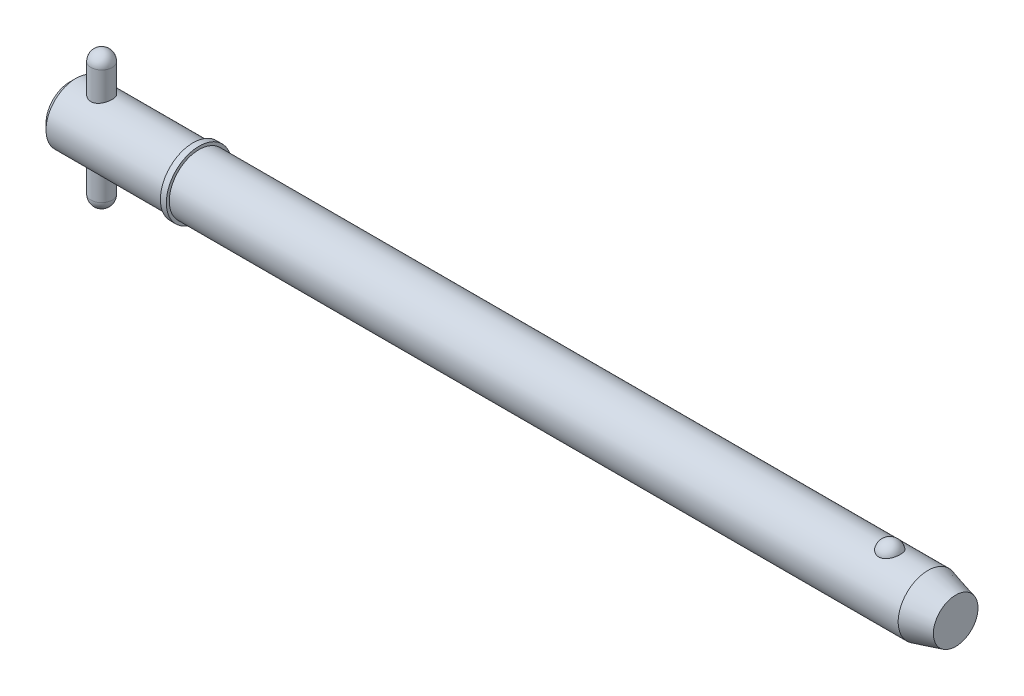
ISO-10303-21;
HEADER;
FILE_DESCRIPTION(('STEP AP214'),'2;1');
FILE_NAME('part.step','',(''),(''),'','','');
FILE_SCHEMA(('AUTOMOTIVE_DESIGN { 1 0 10303 214 1 1 1 1 }'));
ENDSEC;
DATA;
#1=APPLICATION_CONTEXT('core data for automotive mechanical design processes');
#2=APPLICATION_PROTOCOL_DEFINITION('international standard','automotive_design',2000,#1);
#3=PRODUCT_CONTEXT('',#1,'mechanical');
#4=PRODUCT('Part','Part','',(#3));
#5=PRODUCT_RELATED_PRODUCT_CATEGORY('part','',(#4));
#6=PRODUCT_DEFINITION_FORMATION('','',#4);
#7=PRODUCT_DEFINITION_CONTEXT('part definition',#1,'design');
#8=PRODUCT_DEFINITION('design','',#6,#7);
#9=PRODUCT_DEFINITION_SHAPE('','',#8);
#10=(LENGTH_UNIT() NAMED_UNIT(*) SI_UNIT(.MILLI.,.METRE.));
#11=(NAMED_UNIT(*) PLANE_ANGLE_UNIT() SI_UNIT($,.RADIAN.));
#12=(NAMED_UNIT(*) SI_UNIT($,.STERADIAN.) SOLID_ANGLE_UNIT());
#13=UNCERTAINTY_MEASURE_WITH_UNIT(LENGTH_MEASURE(1.E-05),#10,'distance_accuracy_value','');
#14=(GEOMETRIC_REPRESENTATION_CONTEXT(3) GLOBAL_UNCERTAINTY_ASSIGNED_CONTEXT((#13)) GLOBAL_UNIT_ASSIGNED_CONTEXT((#10,
#11,#12)) REPRESENTATION_CONTEXT('',''));
#15=CARTESIAN_POINT('',(0.,0.,0.));
#16=DIRECTION('',(0.,0.,1.));
#17=DIRECTION('',(1.,0.,0.));
#18=AXIS2_PLACEMENT_3D('',#15,#16,#17);
#19=CARTESIAN_POINT('',(5.94,12.7,0.));
#20=DIRECTION('',(0.,-1.,0.));
#21=DIRECTION('',(0.,0.,-1.));
#22=AXIS2_PLACEMENT_3D('',#19,#20,#21);
#23=CYLINDRICAL_SURFACE('',#22,1.98);
#24=CARTESIAN_POINT('',(5.94,-10.72,0.));
#25=DIRECTION('',(0.,-1.,0.));
#26=DIRECTION('',(0.,0.,-1.));
#27=AXIS2_PLACEMENT_3D('',#24,#25,#26);
#28=CIRCLE('',#27,1.98);
#29=CARTESIAN_POINT('',(5.94,-10.72,-1.98));
#30=VERTEX_POINT('',#29);
#31=EDGE_CURVE('P0_E10',#30,#30,#28,.F.);
#32=ORIENTED_EDGE('',*,*,#31,.T.);
#33=EDGE_LOOP('',(#32));
#34=FACE_BOUND('',#33,.T.);
#35=CARTESIAN_POINT('',(5.94,10.72,0.));
#36=DIRECTION('',(0.,-1.,0.));
#37=DIRECTION('',(0.,0.,-1.));
#38=AXIS2_PLACEMENT_3D('',#35,#36,#37);
#39=CIRCLE('',#38,1.98);
#40=CARTESIAN_POINT('',(5.94,10.72,-1.98));
#41=VERTEX_POINT('',#40);
#42=EDGE_CURVE('P0_E21',#41,#41,#39,.T.);
#43=ORIENTED_EDGE('',*,*,#42,.T.);
#44=EDGE_LOOP('',(#43));
#45=FACE_BOUND('',#44,.T.);
#46=ADVANCED_FACE('P0_F14',(#34,#45),#23,.T.);
#47=CARTESIAN_POINT('',(5.94,-10.72,0.));
#48=DIRECTION('',(0.,0.,1.));
#49=DIRECTION('',(1.,0.,0.));
#50=AXIS2_PLACEMENT_3D('',#47,#48,#49);
#51=SPHERICAL_SURFACE('',#50,1.98);
#52=CARTESIAN_POINT('',(5.94,-10.72,0.));
#53=DIRECTION('',(0.,-1.,0.));
#54=DIRECTION('',(0.,0.,-1.));
#55=AXIS2_PLACEMENT_3D('',#52,#53,#54);
#56=SPHERICAL_SURFACE('',#55,1.98);
#57=ORIENTED_EDGE('',*,*,#31,.F.);
#58=EDGE_LOOP('',(#57));
#59=FACE_BOUND('',#58,.T.);
#60=ADVANCED_FACE('P0_F29',(#59),#56,.T.);
#61=CARTESIAN_POINT('',(5.94,10.72,0.));
#62=DIRECTION('',(0.,0.,1.));
#63=DIRECTION('',(1.,0.,0.));
#64=AXIS2_PLACEMENT_3D('',#61,#62,#63);
#65=SPHERICAL_SURFACE('',#64,1.98);
#66=CARTESIAN_POINT('',(5.94,10.72,0.));
#67=DIRECTION('',(0.,-1.,0.));
#68=DIRECTION('',(0.,0.,-1.));
#69=AXIS2_PLACEMENT_3D('',#66,#67,#68);
#70=SPHERICAL_SURFACE('',#69,1.98);
#71=ORIENTED_EDGE('',*,*,#42,.F.);
#72=EDGE_LOOP('',(#71));
#73=FACE_BOUND('',#72,.T.);
#74=ADVANCED_FACE('P0_F16',(#73),#70,.T.);
#75=CLOSED_SHELL('',(#46,#60,#74));
#76=MANIFOLD_SOLID_BREP('P0_B1',#75);
#77=CARTESIAN_POINT('',(0.,0.,0.));
#78=DIRECTION('',(1.,0.,0.));
#79=DIRECTION('',(0.,0.,-1.));
#80=AXIS2_PLACEMENT_3D('',#77,#78,#79);
#81=CYLINDRICAL_SURFACE('',#80,5.555);
#82=CARTESIAN_POINT('',(160.217114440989,0.,0.));
#83=DIRECTION('',(1.,0.,0.));
#84=DIRECTION('',(0.,0.,-1.));
#85=AXIS2_PLACEMENT_3D('',#82,#83,#84);
#86=CIRCLE('',#85,5.555);
#87=CARTESIAN_POINT('',(160.217114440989,0.,-5.555));
#88=VERTEX_POINT('',#87);
#89=EDGE_CURVE('P1_E81',#88,#88,#86,.T.);
#90=ORIENTED_EDGE('',*,*,#89,.F.);
#91=EDGE_LOOP('',(#90));
#92=FACE_BOUND('',#91,.T.);
#93=CARTESIAN_POINT('',(24.13,0.,0.));
#94=DIRECTION('',(1.,0.,0.));
#95=DIRECTION('',(0.,0.,-1.));
#96=AXIS2_PLACEMENT_3D('',#93,#94,#95);
#97=CIRCLE('',#96,5.555);
#98=CARTESIAN_POINT('',(24.13,0.,-5.555));
#99=VERTEX_POINT('',#98);
#100=EDGE_CURVE('P1_E85',#99,#99,#97,.T.);
#101=ORIENTED_EDGE('',*,*,#100,.T.);
#102=EDGE_LOOP('',(#101));
#103=FACE_BOUND('',#102,.T.);
#104=CARTESIAN_POINT('',(153.098626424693,5.16741224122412,2.03859650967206));
#105=CARTESIAN_POINT('',(152.992949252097,5.16740893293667,2.03859990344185));
#106=CARTESIAN_POINT('',(152.88729894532,5.17079470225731,2.03008306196));
#107=CARTESIAN_POINT('',(152.679141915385,5.18392795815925,1.99630721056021));
#108=CARTESIAN_POINT('',(152.576634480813,5.19367399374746,1.97105201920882));
#109=CARTESIAN_POINT('',(152.377771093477,5.21839168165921,1.9046399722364));
#110=CARTESIAN_POINT('',(152.281406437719,5.23335573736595,1.8635062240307));
#111=CARTESIAN_POINT('',(152.097080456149,5.26688076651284,1.76652592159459));
#112=CARTESIAN_POINT('',(152.009120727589,5.28544242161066,1.71067657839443));
#113=CARTESIAN_POINT('',(151.841265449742,5.32479845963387,1.58399959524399));
#114=CARTESIAN_POINT('',(151.76166564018,5.34564089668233,1.51279545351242));
#115=CARTESIAN_POINT('',(151.61512901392,5.38697258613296,1.35828584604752));
#116=CARTESIAN_POINT('',(151.548194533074,5.40746177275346,1.27497815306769));
#117=CARTESIAN_POINT('',(151.42561039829,5.44694508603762,1.0944029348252));
#118=CARTESIAN_POINT('',(151.370598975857,5.46583143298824,0.996677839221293));
#119=CARTESIAN_POINT('',(151.276937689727,5.49908030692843,0.792961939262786));
#120=CARTESIAN_POINT('',(151.238289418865,5.513442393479,0.686970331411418));
#121=CARTESIAN_POINT('',(151.177680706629,5.53635851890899,0.468019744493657));
#122=CARTESIAN_POINT('',(151.155972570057,5.54482455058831,0.354981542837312));
#123=CARTESIAN_POINT('',(151.130636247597,5.55473324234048,0.12659586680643));
#124=CARTESIAN_POINT('',(151.127007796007,5.55617600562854,0.0112484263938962));
#125=CARTESIAN_POINT('',(151.137881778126,5.55189984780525,-0.218011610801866));
#126=CARTESIAN_POINT('',(151.152315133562,5.54620821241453,-0.331928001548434));
#127=CARTESIAN_POINT('',(151.198903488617,5.52828920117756,-0.555544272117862));
#128=CARTESIAN_POINT('',(151.231058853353,5.5160616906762,-0.665244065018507));
#129=CARTESIAN_POINT('',(151.312488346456,5.48630779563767,-0.877469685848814));
#130=CARTESIAN_POINT('',(151.361781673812,5.4687754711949,-0.979987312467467));
#131=CARTESIAN_POINT('',(151.476478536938,5.43024700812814,-1.17486975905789));
#132=CARTESIAN_POINT('',(151.541883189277,5.4092506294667,-1.26723387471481));
#133=CARTESIAN_POINT('',(151.687571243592,5.36600927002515,-1.4394013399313));
#134=CARTESIAN_POINT('',(151.767885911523,5.34376173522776,-1.51917763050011));
#135=CARTESIAN_POINT('',(151.941452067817,5.30057971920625,-1.66360338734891));
#136=CARTESIAN_POINT('',(152.034702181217,5.27964509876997,-1.72825445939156));
#137=CARTESIAN_POINT('',(152.229393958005,5.24205250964,-1.83909478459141));
#138=CARTESIAN_POINT('',(152.330590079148,5.22530519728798,-1.88568407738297));
#139=CARTESIAN_POINT('',(152.540155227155,5.1975091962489,-1.96100802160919));
#140=CARTESIAN_POINT('',(152.648521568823,5.1864583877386,-1.98974931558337));
#141=CARTESIAN_POINT('',(152.863498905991,5.17184410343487,-2.02742262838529));
#142=CARTESIAN_POINT('',(152.969925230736,5.1679328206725,-2.03727608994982));
#143=CARTESIAN_POINT('',(153.182992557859,5.16698995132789,-2.03966777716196));
#144=CARTESIAN_POINT('',(153.289633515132,5.16995704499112,-2.0322093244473));
#145=CARTESIAN_POINT('',(153.496773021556,5.18222383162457,-2.00071170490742));
#146=CARTESIAN_POINT('',(153.597359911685,5.19133213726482,-1.97717337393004));
#147=CARTESIAN_POINT('',(153.793014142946,5.21467637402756,-1.91475248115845));
#148=CARTESIAN_POINT('',(153.888081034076,5.22891272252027,-1.87586867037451));
#149=CARTESIAN_POINT('',(154.072371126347,5.26137066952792,-1.78282713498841));
#150=CARTESIAN_POINT('',(154.161419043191,5.27967329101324,-1.72835124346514));
#151=CARTESIAN_POINT('',(154.329288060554,5.3181741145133,-1.60597483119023));
#152=CARTESIAN_POINT('',(154.408106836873,5.33837274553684,-1.5380712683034));
#153=CARTESIAN_POINT('',(154.557515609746,5.37968287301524,-1.38688970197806));
#154=CARTESIAN_POINT('',(154.627505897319,5.40079011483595,-1.30301744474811));
#155=CARTESIAN_POINT('',(154.753012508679,5.44074401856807,-1.12458170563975));
#156=CARTESIAN_POINT('',(154.808526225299,5.45959027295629,-1.03001630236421));
#157=CARTESIAN_POINT('',(154.905550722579,5.49369849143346,-0.829439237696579));
#158=CARTESIAN_POINT('',(154.946548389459,5.50882422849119,-0.723155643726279));
#159=CARTESIAN_POINT('',(155.011125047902,5.53310911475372,-0.504772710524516));
#160=CARTESIAN_POINT('',(155.034703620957,5.54226812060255,-0.392673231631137));
#161=CARTESIAN_POINT('',(155.064013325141,5.55370358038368,-0.165459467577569));
#162=CARTESIAN_POINT('',(155.069688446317,5.55595843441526,-0.0503368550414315));
#163=CARTESIAN_POINT('',(155.062916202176,5.55329317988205,0.179288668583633));
#164=CARTESIAN_POINT('',(155.050469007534,5.54837313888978,0.293791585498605));
#165=CARTESIAN_POINT('',(155.007779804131,5.53189037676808,0.51852641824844));
#166=CARTESIAN_POINT('',(154.977598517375,5.5203503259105,0.62877154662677));
#167=CARTESIAN_POINT('',(154.900096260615,5.49182453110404,0.842318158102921));
#168=CARTESIAN_POINT('',(154.852774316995,5.47483847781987,0.945619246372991));
#169=CARTESIAN_POINT('',(154.741720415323,5.43710633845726,1.14281571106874));
#170=CARTESIAN_POINT('',(154.677921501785,5.41634501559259,1.23667048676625));
#171=CARTESIAN_POINT('',(154.535357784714,5.37334572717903,1.4118524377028));
#172=CARTESIAN_POINT('',(154.45659323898,5.35110778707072,1.49317982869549));
#173=CARTESIAN_POINT('',(154.286423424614,5.30779474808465,1.64049162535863));
#174=CARTESIAN_POINT('',(154.19510026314,5.28671324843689,1.70656877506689));
#175=CARTESIAN_POINT('',(154.001739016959,5.2480485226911,1.82201372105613));
#176=CARTESIAN_POINT('',(153.899700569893,5.23046541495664,1.87138095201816));
#177=CARTESIAN_POINT('',(153.683618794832,5.20042692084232,1.95335298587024));
#178=CARTESIAN_POINT('',(153.569260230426,5.18820192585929,1.98521734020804));
#179=CARTESIAN_POINT('',(153.336130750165,5.17169804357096,2.02783294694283));
#180=CARTESIAN_POINT('',(153.217361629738,5.16741595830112,2.03859269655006));
#181=CARTESIAN_POINT('',(153.098626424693,5.16741224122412,2.03859650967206));
#182=B_SPLINE_CURVE_WITH_KNOTS('',3,(#104,#105,#106,#107,#108,#109,#110,#111,#112,#113,#114,
#115,#116,#117,#118,#119,#120,#121,#122,#123,#124,#125,#126,#127,#128,#129,#130,#131,#132,#133,
#134,#135,#136,#137,#138,#139,#140,#141,#142,#143,#144,#145,#146,#147,#148,#149,#150,#151,#152,
#153,#154,#155,#156,#157,#158,#159,#160,#161,#162,#163,#164,#165,#166,#167,#168,#169,#170,#171,
#172,#173,#174,#175,#176,#177,#178,#179,#180,#181),.UNSPECIFIED.,.T.,.F.,(4,2,2,2,2,2,2,2,2,2,2,
2,2,2,2,2,2,2,2,2,2,2,2,2,2,2,2,2,2,2,2,2,2,2,2,2,2,2,4),(0.,0.316595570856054,
0.633118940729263,0.94918341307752,1.26530783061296,1.59030762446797,1.91536729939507,
2.25495824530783,2.59458224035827,2.93917283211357,3.28375835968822,3.62703002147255,
3.97030875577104,4.31397329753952,4.657661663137,5.00207904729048,5.34645984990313,
5.68270547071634,6.01882587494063,6.33808403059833,6.65728093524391,6.9669637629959,
7.27667180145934,7.59321535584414,7.90983070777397,8.24210387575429,8.57443684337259,
8.91755896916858,9.26068933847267,9.60489211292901,9.94909164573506,10.2921194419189,
10.6351667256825,10.9796305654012,11.3240884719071,11.6663928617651,12.0087088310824,
12.3645679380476,12.7202837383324),.UNSPECIFIED.);
#183=CARTESIAN_POINT('',(153.098626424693,5.16741224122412,2.03859650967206));
#184=VERTEX_POINT('',#183);
#185=EDGE_CURVE('P1_E35',#184,#184,#182,.T.);
#186=ORIENTED_EDGE('',*,*,#185,.T.);
#187=EDGE_LOOP('',(#186));
#188=FACE_BOUND('',#187,.T.);
#189=ADVANCED_FACE('P1_F13',(#92,#103,#188),#81,.T.);
#190=CARTESIAN_POINT('',(0.,0.,0.));
#191=DIRECTION('',(-1.,0.,0.));
#192=DIRECTION('',(0.,0.,1.));
#193=AXIS2_PLACEMENT_3D('',#190,#191,#192);
#194=PLANE('',#193);
#195=CARTESIAN_POINT('',(0.,0.,0.));
#196=DIRECTION('',(1.,0.,0.));
#197=DIRECTION('',(0.,0.,-1.));
#198=AXIS2_PLACEMENT_3D('',#195,#196,#197);
#199=CIRCLE('',#198,4.444);
#200=CARTESIAN_POINT('',(0.,0.,-4.444));
#201=VERTEX_POINT('',#200);
#202=EDGE_CURVE('P1_E9',#201,#201,#199,.T.);
#203=ORIENTED_EDGE('',*,*,#202,.F.);
#204=EDGE_LOOP('',(#203));
#205=FACE_BOUND('',#204,.T.);
#206=ADVANCED_FACE('P1_F15',(#205),#194,.T.);
#207=CARTESIAN_POINT('',(1.111,0.,0.));
#208=DIRECTION('',(1.,0.,0.));
#209=DIRECTION('',(0.,0.,-1.));
#210=AXIS2_PLACEMENT_3D('',#207,#208,#209);
#211=CONICAL_SURFACE('',#210,5.555,0.78539816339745);
#212=ORIENTED_EDGE('',*,*,#202,.T.);
#213=EDGE_LOOP('',(#212));
#214=FACE_BOUND('',#213,.T.);
#215=CARTESIAN_POINT('',(1.111,0.,0.));
#216=DIRECTION('',(1.,0.,0.));
#217=DIRECTION('',(0.,0.,-1.));
#218=AXIS2_PLACEMENT_3D('',#215,#216,#217);
#219=CIRCLE('',#218,5.555);
#220=CARTESIAN_POINT('',(1.111,0.,-5.555));
#221=VERTEX_POINT('',#220);
#222=EDGE_CURVE('P1_E26',#221,#221,#219,.T.);
#223=ORIENTED_EDGE('',*,*,#222,.F.);
#224=EDGE_LOOP('',(#223));
#225=FACE_BOUND('',#224,.T.);
#226=ADVANCED_FACE('P1_F77',(#214,#225),#211,.T.);
#227=CARTESIAN_POINT('',(0.,0.,0.));
#228=DIRECTION('',(1.,0.,0.));
#229=DIRECTION('',(0.,0.,-1.));
#230=AXIS2_PLACEMENT_3D('',#227,#228,#229);
#231=CYLINDRICAL_SURFACE('',#230,5.555);
#232=CARTESIAN_POINT('',(5.94,-5.19014691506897,1.98));
#233=CARTESIAN_POINT('',(5.83264687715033,-5.19014494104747,1.98000226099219));
#234=CARTESIAN_POINT('',(5.7253094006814,-5.19351395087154,1.97123988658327));
#235=CARTESIAN_POINT('',(5.51384517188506,-5.20654291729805,1.93656219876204));
#236=CARTESIAN_POINT('',(5.40971858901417,-5.21620320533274,1.91064598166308));
#237=CARTESIAN_POINT('',(5.20778082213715,-5.24058443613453,1.84271148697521));
#238=CARTESIAN_POINT('',(5.10995634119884,-5.25529427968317,1.80072850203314));
#239=CARTESIAN_POINT('',(4.92270352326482,-5.28810012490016,1.70197537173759));
#240=CARTESIAN_POINT('',(4.83327743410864,-5.3061970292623,1.64520128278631));
#241=CARTESIAN_POINT('',(4.66135184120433,-5.34464714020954,1.51575187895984));
#242=CARTESIAN_POINT('',(4.57928277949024,-5.36506222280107,1.44252311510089));
#243=CARTESIAN_POINT('',(4.42829115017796,-5.40532920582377,1.28342047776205));
#244=CARTESIAN_POINT('',(4.35937105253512,-5.42518099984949,1.19754423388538));
#245=CARTESIAN_POINT('',(4.23461605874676,-5.46281133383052,1.01237205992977));
#246=CARTESIAN_POINT('',(4.17924129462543,-5.48050875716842,0.912748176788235));
#247=CARTESIAN_POINT('',(4.0862117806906,-5.51109938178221,0.70485824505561));
#248=CARTESIAN_POINT('',(4.0485515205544,-5.52399407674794,0.596594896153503));
#249=CARTESIAN_POINT('',(3.99350662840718,-5.54308759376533,0.379019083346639));
#250=CARTESIAN_POINT('',(3.97538263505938,-5.54952987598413,0.269915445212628));
#251=CARTESIAN_POINT('',(3.95756405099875,-5.55586205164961,0.0500378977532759));
#252=CARTESIAN_POINT('',(3.95786404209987,-5.55575387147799,-0.060735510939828));
#253=CARTESIAN_POINT('',(3.97643665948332,-5.54915684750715,-0.275539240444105));
#254=CARTESIAN_POINT('',(3.99390415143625,-5.54295384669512,-0.379649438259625));
#255=CARTESIAN_POINT('',(4.0449721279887,-5.52523170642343,-0.583350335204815));
#256=CARTESIAN_POINT('',(4.07857373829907,-5.51371219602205,-0.682940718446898));
#257=CARTESIAN_POINT('',(4.16137312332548,-5.4863099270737,-0.876423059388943));
#258=CARTESIAN_POINT('',(4.2107826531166,-5.47036834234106,-0.970215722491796));
#259=CARTESIAN_POINT('',(4.32361427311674,-5.43575653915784,-1.1484017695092));
#260=CARTESIAN_POINT('',(4.38704062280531,-5.41708549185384,-1.23279228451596));
#261=CARTESIAN_POINT('',(4.53006791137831,-5.37778429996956,-1.39454579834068));
#262=CARTESIAN_POINT('',(4.61035105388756,-5.35710277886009,-1.4712940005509));
#263=CARTESIAN_POINT('',(4.78279835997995,-5.31692766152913,-1.6104545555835));
#264=CARTESIAN_POINT('',(4.874964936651,-5.29743430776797,-1.67286398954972));
#265=CARTESIAN_POINT('',(5.07076688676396,-5.26153775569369,-1.78259698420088));
#266=CARTESIAN_POINT('',(5.17458163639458,-5.24519780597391,-1.8296227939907));
#267=CARTESIAN_POINT('',(5.38938990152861,-5.21818744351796,-1.90530278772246));
#268=CARTESIAN_POINT('',(5.50037985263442,-5.20751423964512,-1.93396601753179));
#269=CARTESIAN_POINT('',(5.72036376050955,-5.19369176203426,-1.97077654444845));
#270=CARTESIAN_POINT('',(5.82917370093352,-5.19018851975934,-1.97989015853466));
#271=CARTESIAN_POINT('',(6.04680100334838,-5.19010609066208,-1.98010779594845));
#272=CARTESIAN_POINT('',(6.15561835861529,-5.19352540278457,-1.97121572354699));
#273=CARTESIAN_POINT('',(6.36548036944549,-5.20654623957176,-1.93654727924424));
#274=CARTESIAN_POINT('',(6.46666051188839,-5.21588705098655,-1.91148218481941));
#275=CARTESIAN_POINT('',(6.66334537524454,-5.23939939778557,-1.84605494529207));
#276=CARTESIAN_POINT('',(6.75884899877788,-5.25357186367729,-1.8056898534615));
#277=CARTESIAN_POINT('',(6.94517989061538,-5.28576258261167,-1.70921153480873));
#278=CARTESIAN_POINT('',(7.03572661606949,-5.30389804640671,-1.65259670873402));
#279=CARTESIAN_POINT('',(7.20638087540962,-5.34176077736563,-1.52577523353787));
#280=CARTESIAN_POINT('',(7.28648490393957,-5.36148857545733,-1.45556404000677));
#281=CARTESIAN_POINT('',(7.43864697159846,-5.40165494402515,-1.2988614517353));
#282=CARTESIAN_POINT('',(7.50999887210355,-5.42207106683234,-1.21167640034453));
#283=CARTESIAN_POINT('',(7.63712639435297,-5.46023601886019,-1.026066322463));
#284=CARTESIAN_POINT('',(7.69290228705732,-5.47798489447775,-0.927641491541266));
#285=CARTESIAN_POINT('',(7.78684673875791,-5.50876590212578,-0.722633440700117));
#286=CARTESIAN_POINT('',(7.82510508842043,-5.52182201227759,-0.616095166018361));
#287=CARTESIAN_POINT('',(7.88297051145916,-5.54184206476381,-0.397530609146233));
#288=CARTESIAN_POINT('',(7.90258540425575,-5.5488085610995,-0.285506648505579));
#289=CARTESIAN_POINT('',(7.9218262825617,-5.55564472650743,-0.065566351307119));
#290=CARTESIAN_POINT('',(7.92245987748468,-5.55587212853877,0.0422515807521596));
#291=CARTESIAN_POINT('',(7.90626329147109,-5.55011340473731,0.256387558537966));
#292=CARTESIAN_POINT('',(7.88943488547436,-5.54412791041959,0.362705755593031));
#293=CARTESIAN_POINT('',(7.83948457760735,-5.52676548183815,0.568649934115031));
#294=CARTESIAN_POINT('',(7.8067003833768,-5.51550046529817,0.668367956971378));
#295=CARTESIAN_POINT('',(7.72609369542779,-5.48874437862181,0.860911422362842));
#296=CARTESIAN_POINT('',(7.67826838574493,-5.47325251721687,0.953735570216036));
#297=CARTESIAN_POINT('',(7.56675024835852,-5.43884382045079,1.13391068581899));
#298=CARTESIAN_POINT('',(7.50249968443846,-5.41981485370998,1.22089468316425));
#299=CARTESIAN_POINT('',(7.36086495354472,-5.38069275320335,1.38316665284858));
#300=CARTESIAN_POINT('',(7.28347630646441,-5.36059925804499,1.45845061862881));
#301=CARTESIAN_POINT('',(7.11347587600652,-5.32048380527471,1.59876646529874));
#302=CARTESIAN_POINT('',(7.02032386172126,-5.30050854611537,1.66315951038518));
#303=CARTESIAN_POINT('',(6.82388804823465,-5.26398994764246,1.77536801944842));
#304=CARTESIAN_POINT('',(6.7206049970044,-5.24744635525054,1.82318470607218));
#305=CARTESIAN_POINT('',(6.50639706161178,-5.21987969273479,1.90068230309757));
#306=CARTESIAN_POINT('',(6.3954529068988,-5.20887116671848,1.93031547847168));
#307=CARTESIAN_POINT('',(6.16966522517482,-5.19400760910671,1.96996824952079));
#308=CARTESIAN_POINT('',(6.05482366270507,-5.19014902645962,1.97999758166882));
#309=CARTESIAN_POINT('',(5.94,-5.19014691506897,1.98));
#310=B_SPLINE_CURVE_WITH_KNOTS('',3,(#232,#233,#234,#235,#236,#237,#238,#239,#240,#241,#242,
#243,#244,#245,#246,#247,#248,#249,#250,#251,#252,#253,#254,#255,#256,#257,#258,#259,#260,#261,
#262,#263,#264,#265,#266,#267,#268,#269,#270,#271,#272,#273,#274,#275,#276,#277,#278,#279,#280,
#281,#282,#283,#284,#285,#286,#287,#288,#289,#290,#291,#292,#293,#294,#295,#296,#297,#298,#299,
#300,#301,#302,#303,#304,#305,#306,#307,#308,#309),.UNSPECIFIED.,.T.,.F.,(4,2,2,2,2,2,2,2,2,2,2,
2,2,2,2,2,2,2,2,2,2,2,2,2,2,2,2,2,2,2,2,2,2,2,2,2,2,2,4),(0.,0.321632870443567,
0.643282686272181,0.964229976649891,1.28526292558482,1.61937087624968,1.9535415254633,
2.29784481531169,2.64204093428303,2.97269632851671,3.30325448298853,3.61901541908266,
3.93479838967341,4.25500220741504,4.57530346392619,4.91268648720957,5.25013812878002,
5.59378026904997,5.93725299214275,6.26331481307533,6.58930593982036,6.90185604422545,
7.21446637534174,7.53801472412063,7.86167140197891,8.20353561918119,8.54539388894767,
8.88547970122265,9.22542281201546,9.54728637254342,9.86911722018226,10.1844146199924,
10.4997710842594,10.827730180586,11.1558013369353,11.499115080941,11.8424034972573,
12.1865892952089,12.5306041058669),.UNSPECIFIED.);
#311=CARTESIAN_POINT('',(5.94,-5.19014691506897,1.98));
#312=VERTEX_POINT('',#311);
#313=EDGE_CURVE('P1_E17',#312,#312,#310,.T.);
#314=ORIENTED_EDGE('',*,*,#313,.F.);
#315=EDGE_LOOP('',(#314));
#316=FACE_BOUND('',#315,.T.);
#317=CARTESIAN_POINT('',(5.94,5.19014691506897,1.98));
#318=CARTESIAN_POINT('',(6.04735312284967,5.19014494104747,1.98000226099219));
#319=CARTESIAN_POINT('',(6.1546905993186,5.19351395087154,1.97123988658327));
#320=CARTESIAN_POINT('',(6.36615482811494,5.20654291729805,1.93656219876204));
#321=CARTESIAN_POINT('',(6.47028141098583,5.21620320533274,1.91064598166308));
#322=CARTESIAN_POINT('',(6.67221917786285,5.24058443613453,1.84271148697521));
#323=CARTESIAN_POINT('',(6.77004365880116,5.25529427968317,1.80072850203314));
#324=CARTESIAN_POINT('',(6.95729647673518,5.28810012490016,1.70197537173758));
#325=CARTESIAN_POINT('',(7.04672256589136,5.3061970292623,1.64520128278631));
#326=CARTESIAN_POINT('',(7.21864815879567,5.34464714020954,1.51575187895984));
#327=CARTESIAN_POINT('',(7.30071722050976,5.36506222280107,1.44252311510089));
#328=CARTESIAN_POINT('',(7.45170884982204,5.40532920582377,1.28342047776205));
#329=CARTESIAN_POINT('',(7.52062894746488,5.42518099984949,1.19754423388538));
#330=CARTESIAN_POINT('',(7.64538394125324,5.46281133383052,1.01237205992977));
#331=CARTESIAN_POINT('',(7.70075870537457,5.48050875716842,0.912748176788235));
#332=CARTESIAN_POINT('',(7.7937882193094,5.51109938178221,0.704858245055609));
#333=CARTESIAN_POINT('',(7.8314484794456,5.52399407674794,0.596594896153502));
#334=CARTESIAN_POINT('',(7.88649337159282,5.54308759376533,0.379019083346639));
#335=CARTESIAN_POINT('',(7.90461736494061,5.54952987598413,0.269915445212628));
#336=CARTESIAN_POINT('',(7.92243594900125,5.55586205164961,0.0500378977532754));
#337=CARTESIAN_POINT('',(7.92213595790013,5.55575387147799,-0.0607355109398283));
#338=CARTESIAN_POINT('',(7.90356334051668,5.54915684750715,-0.275539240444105));
#339=CARTESIAN_POINT('',(7.88609584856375,5.54295384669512,-0.379649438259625));
#340=CARTESIAN_POINT('',(7.8350278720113,5.52523170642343,-0.583350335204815));
#341=CARTESIAN_POINT('',(7.80142626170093,5.51371219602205,-0.682940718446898));
#342=CARTESIAN_POINT('',(7.71862687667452,5.4863099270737,-0.876423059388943));
#343=CARTESIAN_POINT('',(7.6692173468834,5.47036834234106,-0.970215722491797));
#344=CARTESIAN_POINT('',(7.55638572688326,5.43575653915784,-1.1484017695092));
#345=CARTESIAN_POINT('',(7.49295937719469,5.41708549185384,-1.23279228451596));
#346=CARTESIAN_POINT('',(7.34993208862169,5.37778429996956,-1.39454579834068));
#347=CARTESIAN_POINT('',(7.26964894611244,5.35710277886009,-1.4712940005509));
#348=CARTESIAN_POINT('',(7.09720164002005,5.31692766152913,-1.6104545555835));
#349=CARTESIAN_POINT('',(7.00503506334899,5.29743430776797,-1.67286398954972));
#350=CARTESIAN_POINT('',(6.80923311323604,5.26153775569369,-1.78259698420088));
#351=CARTESIAN_POINT('',(6.70541836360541,5.24519780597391,-1.8296227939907));
#352=CARTESIAN_POINT('',(6.49061009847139,5.21818744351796,-1.90530278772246));
#353=CARTESIAN_POINT('',(6.37962014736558,5.20751423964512,-1.93396601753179));
#354=CARTESIAN_POINT('',(6.15963623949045,5.19369176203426,-1.97077654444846));
#355=CARTESIAN_POINT('',(6.05082629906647,5.19018851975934,-1.97989015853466));
#356=CARTESIAN_POINT('',(5.83319899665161,5.19010609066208,-1.98010779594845));
#357=CARTESIAN_POINT('',(5.7243816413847,5.19352540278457,-1.97121572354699));
#358=CARTESIAN_POINT('',(5.5145196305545,5.20654623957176,-1.93654727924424));
#359=CARTESIAN_POINT('',(5.4133394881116,5.21588705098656,-1.91148218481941));
#360=CARTESIAN_POINT('',(5.21665462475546,5.23939939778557,-1.84605494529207));
#361=CARTESIAN_POINT('',(5.12115100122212,5.25357186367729,-1.8056898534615));
#362=CARTESIAN_POINT('',(4.93482010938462,5.28576258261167,-1.70921153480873));
#363=CARTESIAN_POINT('',(4.84427338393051,5.30389804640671,-1.65259670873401));
#364=CARTESIAN_POINT('',(4.67361912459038,5.34176077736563,-1.52577523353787));
#365=CARTESIAN_POINT('',(4.59351509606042,5.36148857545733,-1.45556404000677));
#366=CARTESIAN_POINT('',(4.44135302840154,5.40165494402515,-1.2988614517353));
#367=CARTESIAN_POINT('',(4.37000112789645,5.42207106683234,-1.21167640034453));
#368=CARTESIAN_POINT('',(4.24287360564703,5.46023601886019,-1.026066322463));
#369=CARTESIAN_POINT('',(4.18709771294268,5.47798489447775,-0.927641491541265));
#370=CARTESIAN_POINT('',(4.09315326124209,5.50876590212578,-0.722633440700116));
#371=CARTESIAN_POINT('',(4.05489491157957,5.52182201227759,-0.61609516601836));
#372=CARTESIAN_POINT('',(3.99702948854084,5.54184206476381,-0.397530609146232));
#373=CARTESIAN_POINT('',(3.97741459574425,5.5488085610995,-0.285506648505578));
#374=CARTESIAN_POINT('',(3.9581737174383,5.55564472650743,-0.0655663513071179));
#375=CARTESIAN_POINT('',(3.95754012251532,5.55587212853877,0.0422515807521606));
#376=CARTESIAN_POINT('',(3.97373670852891,5.55011340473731,0.256387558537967));
#377=CARTESIAN_POINT('',(3.99056511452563,5.54412791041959,0.362705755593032));
#378=CARTESIAN_POINT('',(4.04051542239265,5.52676548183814,0.568649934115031));
#379=CARTESIAN_POINT('',(4.07329961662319,5.51550046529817,0.668367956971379));
#380=CARTESIAN_POINT('',(4.15390630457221,5.48874437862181,0.860911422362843));
#381=CARTESIAN_POINT('',(4.20173161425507,5.47325251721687,0.953735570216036));
#382=CARTESIAN_POINT('',(4.31324975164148,5.43884382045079,1.13391068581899));
#383=CARTESIAN_POINT('',(4.37750031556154,5.41981485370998,1.22089468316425));
#384=CARTESIAN_POINT('',(4.51913504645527,5.38069275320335,1.38316665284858));
#385=CARTESIAN_POINT('',(4.59652369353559,5.36059925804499,1.45845061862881));
#386=CARTESIAN_POINT('',(4.76652412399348,5.32048380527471,1.59876646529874));
#387=CARTESIAN_POINT('',(4.85967613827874,5.30050854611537,1.66315951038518));
#388=CARTESIAN_POINT('',(5.05611195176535,5.26398994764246,1.77536801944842));
#389=CARTESIAN_POINT('',(5.1593950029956,5.24744635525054,1.82318470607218));
#390=CARTESIAN_POINT('',(5.37360293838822,5.21987969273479,1.90068230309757));
#391=CARTESIAN_POINT('',(5.4845470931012,5.20887116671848,1.93031547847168));
#392=CARTESIAN_POINT('',(5.71033477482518,5.19400760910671,1.96996824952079));
#393=CARTESIAN_POINT('',(5.82517633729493,5.19014902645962,1.97999758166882));
#394=CARTESIAN_POINT('',(5.94,5.19014691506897,1.98));
#395=B_SPLINE_CURVE_WITH_KNOTS('',3,(#317,#318,#319,#320,#321,#322,#323,#324,#325,#326,#327,
#328,#329,#330,#331,#332,#333,#334,#335,#336,#337,#338,#339,#340,#341,#342,#343,#344,#345,#346,
#347,#348,#349,#350,#351,#352,#353,#354,#355,#356,#357,#358,#359,#360,#361,#362,#363,#364,#365,
#366,#367,#368,#369,#370,#371,#372,#373,#374,#375,#376,#377,#378,#379,#380,#381,#382,#383,#384,
#385,#386,#387,#388,#389,#390,#391,#392,#393,#394),.UNSPECIFIED.,.T.,.F.,(4,2,2,2,2,2,2,2,2,2,2,
2,2,2,2,2,2,2,2,2,2,2,2,2,2,2,2,2,2,2,2,2,2,2,2,2,2,2,4),(0.,0.321632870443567,
0.643282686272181,0.964229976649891,1.28526292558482,1.61937087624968,1.9535415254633,
2.29784481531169,2.64204093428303,2.97269632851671,3.30325448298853,3.61901541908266,
3.93479838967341,4.25500220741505,4.57530346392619,4.91268648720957,5.25013812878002,
5.59378026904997,5.93725299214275,6.26331481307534,6.58930593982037,6.90185604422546,
7.21446637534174,7.53801472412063,7.86167140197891,8.20353561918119,8.54539388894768,
8.88547970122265,9.22542281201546,9.54728637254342,9.86911722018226,10.1844146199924,
10.4997710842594,10.827730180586,11.1558013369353,11.499115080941,11.8424034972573,
12.1865892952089,12.5306041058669),.UNSPECIFIED.);
#396=CARTESIAN_POINT('',(5.94,5.19014691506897,1.98));
#397=VERTEX_POINT('',#396);
#398=EDGE_CURVE('P1_E43',#397,#397,#395,.T.);
#399=ORIENTED_EDGE('',*,*,#398,.F.);
#400=EDGE_LOOP('',(#399));
#401=FACE_BOUND('',#400,.T.);
#402=ORIENTED_EDGE('',*,*,#222,.T.);
#403=EDGE_LOOP('',(#402));
#404=FACE_BOUND('',#403,.T.);
#405=CARTESIAN_POINT('',(23.019,0.,0.));
#406=DIRECTION('',(1.,0.,0.));
#407=DIRECTION('',(0.,0.,-1.));
#408=AXIS2_PLACEMENT_3D('',#405,#406,#407);
#409=CIRCLE('',#408,5.555);
#410=CARTESIAN_POINT('',(23.019,0.,-5.555));
#411=VERTEX_POINT('',#410);
#412=EDGE_CURVE('P1_E31',#411,#411,#409,.T.);
#413=ORIENTED_EDGE('',*,*,#412,.F.);
#414=EDGE_LOOP('',(#413));
#415=FACE_BOUND('',#414,.T.);
#416=ADVANCED_FACE('P1_F103',(#316,#401,#404,#415),#231,.T.);
#417=CARTESIAN_POINT('',(23.019,5.555,0.));
#418=DIRECTION('',(-1.,0.,0.));
#419=DIRECTION('',(0.,0.,1.));
#420=AXIS2_PLACEMENT_3D('',#417,#418,#419);
#421=PLANE('',#420);
#422=ORIENTED_EDGE('',*,*,#412,.T.);
#423=EDGE_LOOP('',(#422));
#424=FACE_BOUND('',#423,.T.);
#425=CARTESIAN_POINT('',(23.019,0.,0.));
#426=DIRECTION('',(1.,0.,0.));
#427=DIRECTION('',(0.,0.,-1.));
#428=AXIS2_PLACEMENT_3D('',#425,#426,#427);
#429=CIRCLE('',#428,6.1105);
#430=CARTESIAN_POINT('',(23.019,0.,-6.1105));
#431=VERTEX_POINT('',#430);
#432=EDGE_CURVE('P1_E91',#431,#431,#429,.T.);
#433=ORIENTED_EDGE('',*,*,#432,.F.);
#434=EDGE_LOOP('',(#433));
#435=FACE_BOUND('',#434,.T.);
#436=ADVANCED_FACE('P1_F100',(#424,#435),#421,.T.);
#437=CARTESIAN_POINT('',(0.,0.,0.));
#438=DIRECTION('',(1.,0.,0.));
#439=DIRECTION('',(0.,0.,-1.));
#440=AXIS2_PLACEMENT_3D('',#437,#438,#439);
#441=CYLINDRICAL_SURFACE('',#440,6.1105);
#442=ORIENTED_EDGE('',*,*,#432,.T.);
#443=EDGE_LOOP('',(#442));
#444=FACE_BOUND('',#443,.T.);
#445=CARTESIAN_POINT('',(24.13,0.,0.));
#446=DIRECTION('',(1.,0.,0.));
#447=DIRECTION('',(0.,0.,-1.));
#448=AXIS2_PLACEMENT_3D('',#445,#446,#447);
#449=CIRCLE('',#448,6.1105);
#450=CARTESIAN_POINT('',(24.13,0.,-6.1105));
#451=VERTEX_POINT('',#450);
#452=EDGE_CURVE('P1_E88',#451,#451,#449,.T.);
#453=ORIENTED_EDGE('',*,*,#452,.F.);
#454=EDGE_LOOP('',(#453));
#455=FACE_BOUND('',#454,.T.);
#456=ADVANCED_FACE('P1_F68',(#444,#455),#441,.T.);
#457=CARTESIAN_POINT('',(24.13,6.1105,0.));
#458=DIRECTION('',(1.,0.,0.));
#459=DIRECTION('',(0.,0.,-1.));
#460=AXIS2_PLACEMENT_3D('',#457,#458,#459);
#461=PLANE('',#460);
#462=ORIENTED_EDGE('',*,*,#452,.T.);
#463=EDGE_LOOP('',(#462));
#464=FACE_BOUND('',#463,.T.);
#465=ORIENTED_EDGE('',*,*,#100,.F.);
#466=EDGE_LOOP('',(#465));
#467=FACE_BOUND('',#466,.T.);
#468=ADVANCED_FACE('P1_F62',(#464,#467),#461,.T.);
#469=CARTESIAN_POINT('',(165.4,0.,0.));
#470=DIRECTION('',(-1.,0.,0.));
#471=DIRECTION('',(0.,0.,1.));
#472=AXIS2_PLACEMENT_3D('',#469,#470,#471);
#473=CONICAL_SURFACE('',#472,4.16625000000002,0.261799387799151);
#474=ORIENTED_EDGE('',*,*,#89,.T.);
#475=EDGE_LOOP('',(#474));
#476=FACE_BOUND('',#475,.T.);
#477=CARTESIAN_POINT('',(165.4,0.,0.));
#478=DIRECTION('',(1.,0.,0.));
#479=DIRECTION('',(0.,0.,-1.));
#480=AXIS2_PLACEMENT_3D('',#477,#478,#479);
#481=CIRCLE('',#480,4.16625000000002);
#482=CARTESIAN_POINT('',(165.4,0.,-4.16625000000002));
#483=VERTEX_POINT('',#482);
#484=EDGE_CURVE('P1_E42',#483,#483,#481,.T.);
#485=ORIENTED_EDGE('',*,*,#484,.F.);
#486=EDGE_LOOP('',(#485));
#487=FACE_BOUND('',#486,.T.);
#488=ADVANCED_FACE('P1_F59',(#476,#487),#473,.T.);
#489=CARTESIAN_POINT('',(165.4,4.16625000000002,0.));
#490=DIRECTION('',(1.,0.,0.));
#491=DIRECTION('',(0.,0.,-1.));
#492=AXIS2_PLACEMENT_3D('',#489,#490,#491);
#493=PLANE('',#492);
#494=ORIENTED_EDGE('',*,*,#484,.T.);
#495=EDGE_LOOP('',(#494));
#496=FACE_BOUND('',#495,.T.);
#497=ADVANCED_FACE('P1_F55',(#496),#493,.T.);
#498=CARTESIAN_POINT('',(153.098626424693,4.9995,0.));
#499=DIRECTION('',(-1.,0.,0.));
#500=DIRECTION('',(0.,1.,0.));
#501=AXIS2_PLACEMENT_3D('',#498,#499,#500);
#502=SPHERICAL_SURFACE('',#501,2.04550000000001);
#503=ORIENTED_EDGE('',*,*,#185,.F.);
#504=EDGE_LOOP('',(#503));
#505=FACE_BOUND('',#504,.T.);
#506=ADVANCED_FACE('P1_F50',(#505),#502,.T.);
#507=CARTESIAN_POINT('',(5.94,-6.1105,0.));
#508=DIRECTION('',(0.,1.,0.));
#509=DIRECTION('',(0.,0.,1.));
#510=AXIS2_PLACEMENT_3D('',#507,#508,#509);
#511=CYLINDRICAL_SURFACE('',#510,1.98);
#512=ORIENTED_EDGE('',*,*,#313,.T.);
#513=EDGE_LOOP('',(#512));
#514=FACE_BOUND('',#513,.T.);
#515=ORIENTED_EDGE('',*,*,#398,.T.);
#516=EDGE_LOOP('',(#515));
#517=FACE_BOUND('',#516,.T.);
#518=ADVANCED_FACE('P1_F54',(#514,#517),#511,.F.);
#519=CLOSED_SHELL('',(#189,#206,#226,#416,#436,#456,#468,#488,#497,#506,#518));
#520=MANIFOLD_SOLID_BREP('P1_B1',#519);
#521=ADVANCED_BREP_SHAPE_REPRESENTATION('',(#18,#76,#520),#14);
#522=SHAPE_DEFINITION_REPRESENTATION(#9,#521);
ENDSEC;
END-ISO-10303-21;
